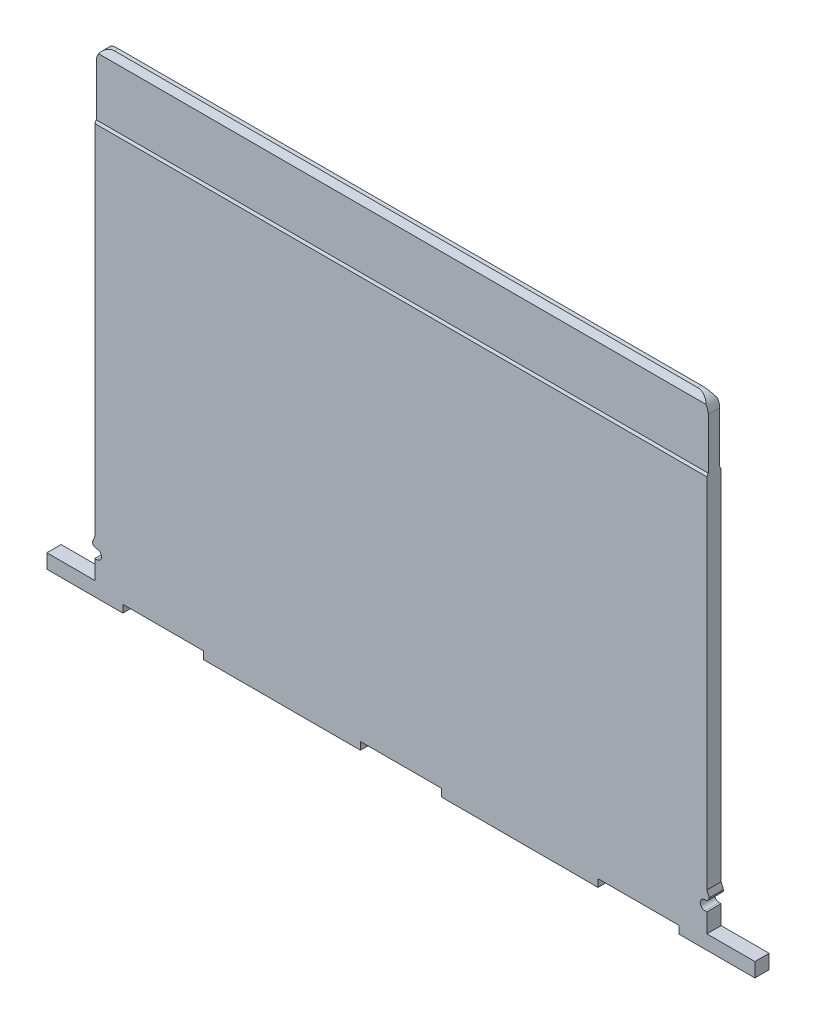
ISO-10303-21;
HEADER;
FILE_DESCRIPTION(('STEP AP214'),'2;1');
FILE_NAME('part.step','',(''),(''),'','','');
FILE_SCHEMA(('AUTOMOTIVE_DESIGN { 1 0 10303 214 1 1 1 1 }'));
ENDSEC;
DATA;
#1=APPLICATION_CONTEXT('core data for automotive mechanical design processes');
#2=APPLICATION_PROTOCOL_DEFINITION('international standard','automotive_design',2000,#1);
#3=PRODUCT_CONTEXT('',#1,'mechanical');
#4=PRODUCT('Part','Part','',(#3));
#5=PRODUCT_RELATED_PRODUCT_CATEGORY('part','',(#4));
#6=PRODUCT_DEFINITION_FORMATION('','',#4);
#7=PRODUCT_DEFINITION_CONTEXT('part definition',#1,'design');
#8=PRODUCT_DEFINITION('design','',#6,#7);
#9=PRODUCT_DEFINITION_SHAPE('','',#8);
#10=(LENGTH_UNIT() NAMED_UNIT(*) SI_UNIT(.MILLI.,.METRE.));
#11=(NAMED_UNIT(*) PLANE_ANGLE_UNIT() SI_UNIT($,.RADIAN.));
#12=(NAMED_UNIT(*) SI_UNIT($,.STERADIAN.) SOLID_ANGLE_UNIT());
#13=UNCERTAINTY_MEASURE_WITH_UNIT(LENGTH_MEASURE(1.E-05),#10,'distance_accuracy_value','');
#14=(GEOMETRIC_REPRESENTATION_CONTEXT(3) GLOBAL_UNCERTAINTY_ASSIGNED_CONTEXT((#13)) GLOBAL_UNIT_ASSIGNED_CONTEXT((#10,
#11,#12)) REPRESENTATION_CONTEXT('',''));
#15=CARTESIAN_POINT('',(0.,0.,0.));
#16=DIRECTION('',(0.,0.,1.));
#17=DIRECTION('',(1.,0.,0.));
#18=AXIS2_PLACEMENT_3D('',#15,#16,#17);
#19=CARTESIAN_POINT('',(10.00000032,12.55776,0.0508));
#20=DIRECTION('',(0.,-0.50000000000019,-0.866025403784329));
#21=DIRECTION('',(0.,0.866025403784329,-0.50000000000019));
#22=AXIS2_PLACEMENT_3D('',#19,#20,#21);
#23=PLANE('',#22);
#24=CARTESIAN_POINT('',(-7.7978,12.17676,0.270770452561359));
#25=DIRECTION('',(0.,-0.50000000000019,-0.866025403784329));
#26=DIRECTION('',(0.,-0.866025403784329,0.50000000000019));
#27=AXIS2_PLACEMENT_3D('',#24,#25,#26);
#28=ELLIPSE('',#27,0.439940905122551,0.381);
#29=CARTESIAN_POINT('',(-8.11893285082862,12.381783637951,0.1524));
#30=VERTEX_POINT('',#29);
#31=CARTESIAN_POINT('',(-7.7978,12.55776,0.0508000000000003));
#32=VERTEX_POINT('',#31);
#33=EDGE_CURVE('E266',#30,#32,#28,.T.);
#34=ORIENTED_EDGE('',*,*,#33,.F.);
#35=DIRECTION('',(-1.,0.,0.));
#36=VECTOR('',#35,1.);
#37=CARTESIAN_POINT('',(10.00000032,12.381783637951,0.1524));
#38=LINE('',#37,#36);
#39=CARTESIAN_POINT('',(8.11893285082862,12.381783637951,0.1524));
#40=VERTEX_POINT('',#39);
#41=EDGE_CURVE('E261',#30,#40,#38,.F.);
#42=ORIENTED_EDGE('',*,*,#41,.T.);
#43=CARTESIAN_POINT('',(7.7978,12.17676,0.270770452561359));
#44=DIRECTION('',(0.,-0.50000000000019,-0.866025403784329));
#45=DIRECTION('',(0.,-0.866025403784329,0.50000000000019));
#46=AXIS2_PLACEMENT_3D('',#43,#44,#45);
#47=ELLIPSE('',#46,0.439940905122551,0.381);
#48=CARTESIAN_POINT('',(7.7978,12.55776,0.0508000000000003));
#49=VERTEX_POINT('',#48);
#50=EDGE_CURVE('E19',#49,#40,#47,.T.);
#51=ORIENTED_EDGE('',*,*,#50,.F.);
#52=DIRECTION('',(1.,0.,0.));
#53=VECTOR('',#52,1.);
#54=CARTESIAN_POINT('',(7.7978,12.55776,0.0508));
#55=LINE('',#54,#53);
#56=EDGE_CURVE('E259',#49,#32,#55,.F.);
#57=ORIENTED_EDGE('',*,*,#56,.T.);
#58=EDGE_LOOP('',(#34,#42,#51,#57));
#59=FACE_BOUND('',#58,.T.);
#60=ADVANCED_FACE('F16',(#59),#23,.F.);
#61=CARTESIAN_POINT('',(7.7978,12.55776,0.399999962));
#62=DIRECTION('',(0.,-1.,0.));
#63=DIRECTION('',(0.,0.,-1.));
#64=AXIS2_PLACEMENT_3D('',#61,#62,#63);
#65=PLANE('',#64);
#66=ORIENTED_EDGE('',*,*,#56,.F.);
#67=DIRECTION('',(0.,0.,-1.));
#68=VECTOR('',#67,1.);
#69=CARTESIAN_POINT('',(7.7978,12.55776,0.399999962));
#70=LINE('',#69,#68);
#71=CARTESIAN_POINT('',(7.7978,12.55776,-0.0507999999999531));
#72=VERTEX_POINT('',#71);
#73=EDGE_CURVE('E271',#72,#49,#70,.F.);
#74=ORIENTED_EDGE('',*,*,#73,.F.);
#75=DIRECTION('',(1.,0.,0.));
#76=VECTOR('',#75,1.);
#77=CARTESIAN_POINT('',(10.00000032,12.55776,-0.0507999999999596));
#78=LINE('',#77,#76);
#79=CARTESIAN_POINT('',(-7.7978,12.55776,-0.0507999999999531));
#80=VERTEX_POINT('',#79);
#81=EDGE_CURVE('E332',#72,#80,#78,.F.);
#82=ORIENTED_EDGE('',*,*,#81,.T.);
#83=DIRECTION('',(0.,0.,-1.));
#84=VECTOR('',#83,1.);
#85=CARTESIAN_POINT('',(-7.7978,12.55776,0.399999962));
#86=LINE('',#85,#84);
#87=EDGE_CURVE('E273',#32,#80,#86,.T.);
#88=ORIENTED_EDGE('',*,*,#87,.F.);
#89=EDGE_LOOP('',(#66,#74,#82,#88));
#90=FACE_BOUND('',#89,.T.);
#91=ADVANCED_FACE('F269',(#90),#65,.F.);
#92=CARTESIAN_POINT('',(10.00000032,12.381783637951,0.1524));
#93=DIRECTION('',(0.,0.,-1.));
#94=DIRECTION('',(-1.,0.,0.));
#95=AXIS2_PLACEMENT_3D('',#92,#93,#94);
#96=PLANE('',#95);
#97=ORIENTED_EDGE('',*,*,#41,.F.);
#98=CARTESIAN_POINT('',(-7.7978,12.17676,0.1524));
#99=DIRECTION('',(0.,0.,1.));
#100=DIRECTION('',(1.,0.,0.));
#101=AXIS2_PLACEMENT_3D('',#98,#99,#100);
#102=CIRCLE('',#101,0.381);
#103=CARTESIAN_POINT('',(-8.1788,12.17676,0.1524));
#104=VERTEX_POINT('',#103);
#105=EDGE_CURVE('E335',#104,#30,#102,.F.);
#106=ORIENTED_EDGE('',*,*,#105,.F.);
#107=DIRECTION('',(0.,1.,0.));
#108=VECTOR('',#107,1.);
#109=CARTESIAN_POINT('',(-8.1788,12.381783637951,0.1524));
#110=LINE('',#109,#108);
#111=CARTESIAN_POINT('',(-8.1788,10.820351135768,0.1524));
#112=VERTEX_POINT('',#111);
#113=EDGE_CURVE('E337',#112,#104,#110,.T.);
#114=ORIENTED_EDGE('',*,*,#113,.F.);
#115=DIRECTION('',(1.,0.,0.));
#116=VECTOR('',#115,1.);
#117=CARTESIAN_POINT('',(10.00000032,10.820351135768,0.1524));
#118=LINE('',#117,#116);
#119=CARTESIAN_POINT('',(8.1788,10.820351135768,0.1524));
#120=VERTEX_POINT('',#119);
#121=EDGE_CURVE('E328',#112,#120,#118,.T.);
#122=ORIENTED_EDGE('',*,*,#121,.T.);
#123=DIRECTION('',(0.,1.,0.));
#124=VECTOR('',#123,1.);
#125=CARTESIAN_POINT('',(8.1788,12.381783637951,0.1524));
#126=LINE('',#125,#124);
#127=CARTESIAN_POINT('',(8.1788,12.17676,0.1524));
#128=VERTEX_POINT('',#127);
#129=EDGE_CURVE('E284',#128,#120,#126,.F.);
#130=ORIENTED_EDGE('',*,*,#129,.F.);
#131=CARTESIAN_POINT('',(7.7978,12.17676,0.1524));
#132=DIRECTION('',(0.,0.,1.));
#133=DIRECTION('',(1.,0.,0.));
#134=AXIS2_PLACEMENT_3D('',#131,#132,#133);
#135=CIRCLE('',#134,0.381);
#136=EDGE_CURVE('E333',#40,#128,#135,.F.);
#137=ORIENTED_EDGE('',*,*,#136,.F.);
#138=EDGE_LOOP('',(#97,#106,#114,#122,#130,#137));
#139=FACE_BOUND('',#138,.T.);
#140=ADVANCED_FACE('F378',(#139),#96,.F.);
#141=CARTESIAN_POINT('',(10.00000032,12.381783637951,-0.1524));
#142=DIRECTION('',(0.,-0.50000000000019,0.866025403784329));
#143=DIRECTION('',(0.,-0.866025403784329,-0.50000000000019));
#144=AXIS2_PLACEMENT_3D('',#141,#142,#143);
#145=PLANE('',#144);
#146=CARTESIAN_POINT('',(-7.7978,12.17676,-0.270770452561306));
#147=DIRECTION('',(0.,-0.50000000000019,0.866025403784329));
#148=DIRECTION('',(0.,0.866025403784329,0.50000000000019));
#149=AXIS2_PLACEMENT_3D('',#146,#147,#148);
#150=ELLIPSE('',#149,0.439940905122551,0.381);
#151=CARTESIAN_POINT('',(-8.11893285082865,12.381783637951,-0.1524));
#152=VERTEX_POINT('',#151);
#153=EDGE_CURVE('E329',#80,#152,#150,.T.);
#154=ORIENTED_EDGE('',*,*,#153,.F.);
#155=ORIENTED_EDGE('',*,*,#81,.F.);
#156=CARTESIAN_POINT('',(7.7978,12.17676,-0.270770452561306));
#157=DIRECTION('',(0.,-0.50000000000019,0.866025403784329));
#158=DIRECTION('',(0.,0.866025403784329,0.50000000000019));
#159=AXIS2_PLACEMENT_3D('',#156,#157,#158);
#160=ELLIPSE('',#159,0.439940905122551,0.381);
#161=CARTESIAN_POINT('',(8.11893285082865,12.381783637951,-0.1524));
#162=VERTEX_POINT('',#161);
#163=EDGE_CURVE('E278',#162,#72,#160,.T.);
#164=ORIENTED_EDGE('',*,*,#163,.F.);
#165=DIRECTION('',(1.,0.,0.));
#166=VECTOR('',#165,1.);
#167=CARTESIAN_POINT('',(10.00000032,12.381783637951,-0.1524));
#168=LINE('',#167,#166);
#169=EDGE_CURVE('E326',#162,#152,#168,.F.);
#170=ORIENTED_EDGE('',*,*,#169,.T.);
#171=EDGE_LOOP('',(#154,#155,#164,#170));
#172=FACE_BOUND('',#171,.T.);
#173=ADVANCED_FACE('F373',(#172),#145,.F.);
#174=CARTESIAN_POINT('',(10.00000032,10.820351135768,0.1524));
#175=DIRECTION('',(0.,-0.50000000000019,-0.866025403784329));
#176=DIRECTION('',(0.,0.866025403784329,-0.50000000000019));
#177=AXIS2_PLACEMENT_3D('',#174,#175,#176);
#178=PLANE('',#177);
#179=DIRECTION('',(0.,0.866025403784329,-0.50000000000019));
#180=VECTOR('',#179,1.);
#181=CARTESIAN_POINT('',(-8.1788,10.820351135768,0.1524));
#182=LINE('',#181,#180);
#183=CARTESIAN_POINT('',(-8.1788,10.75436,0.190499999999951));
#184=VERTEX_POINT('',#183);
#185=EDGE_CURVE('E354',#184,#112,#182,.T.);
#186=ORIENTED_EDGE('',*,*,#185,.F.);
#187=DIRECTION('',(-1.,0.,0.));
#188=VECTOR('',#187,1.);
#189=CARTESIAN_POINT('',(10.00000032,10.75436,0.1905));
#190=LINE('',#189,#188);
#191=CARTESIAN_POINT('',(8.1788,10.75436,0.190499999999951));
#192=VERTEX_POINT('',#191);
#193=EDGE_CURVE('E322',#184,#192,#190,.F.);
#194=ORIENTED_EDGE('',*,*,#193,.T.);
#195=DIRECTION('',(0.,0.866025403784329,-0.50000000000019));
#196=VECTOR('',#195,1.);
#197=CARTESIAN_POINT('',(8.1788,10.820351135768,0.1524));
#198=LINE('',#197,#196);
#199=EDGE_CURVE('E331',#120,#192,#198,.F.);
#200=ORIENTED_EDGE('',*,*,#199,.F.);
#201=ORIENTED_EDGE('',*,*,#121,.F.);
#202=EDGE_LOOP('',(#186,#194,#200,#201));
#203=FACE_BOUND('',#202,.T.);
#204=ADVANCED_FACE('F796',(#203),#178,.F.);
#205=CARTESIAN_POINT('',(7.7978,12.17676,0.399999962));
#206=DIRECTION('',(0.,0.,1.));
#207=DIRECTION('',(1.,0.,0.));
#208=AXIS2_PLACEMENT_3D('',#205,#206,#207);
#209=CYLINDRICAL_SURFACE('',#208,0.381);
#210=ORIENTED_EDGE('',*,*,#163,.T.);
#211=ORIENTED_EDGE('',*,*,#73,.T.);
#212=ORIENTED_EDGE('',*,*,#50,.T.);
#213=ORIENTED_EDGE('',*,*,#136,.T.);
#214=DIRECTION('',(0.,0.,1.));
#215=VECTOR('',#214,1.);
#216=CARTESIAN_POINT('',(8.1788,12.17676,0.399999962));
#217=LINE('',#216,#215);
#218=CARTESIAN_POINT('',(8.1788,12.17676,-0.1524));
#219=VERTEX_POINT('',#218);
#220=EDGE_CURVE('E381',#128,#219,#217,.F.);
#221=ORIENTED_EDGE('',*,*,#220,.T.);
#222=CARTESIAN_POINT('',(7.7978,12.17676,-0.1524));
#223=DIRECTION('',(0.,0.,1.));
#224=DIRECTION('',(1.,0.,0.));
#225=AXIS2_PLACEMENT_3D('',#222,#223,#224);
#226=CIRCLE('',#225,0.381);
#227=EDGE_CURVE('E324',#219,#162,#226,.T.);
#228=ORIENTED_EDGE('',*,*,#227,.T.);
#229=EDGE_LOOP('',(#210,#211,#212,#213,#221,#228));
#230=FACE_BOUND('',#229,.T.);
#231=ADVANCED_FACE('F276',(#230),#209,.T.);
#232=CARTESIAN_POINT('',(10.00000032,10.820351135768,-0.1524));
#233=DIRECTION('',(0.,0.,1.));
#234=DIRECTION('',(1.,0.,0.));
#235=AXIS2_PLACEMENT_3D('',#232,#233,#234);
#236=PLANE('',#235);
#237=DIRECTION('',(0.,1.,0.));
#238=VECTOR('',#237,1.);
#239=CARTESIAN_POINT('',(-8.1788,10.820351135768,-0.1524));
#240=LINE('',#239,#238);
#241=CARTESIAN_POINT('',(-8.1788,12.17676,-0.1524));
#242=VERTEX_POINT('',#241);
#243=CARTESIAN_POINT('',(-8.1788,10.820351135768,-0.152400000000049));
#244=VERTEX_POINT('',#243);
#245=EDGE_CURVE('E323',#242,#244,#240,.F.);
#246=ORIENTED_EDGE('',*,*,#245,.F.);
#247=CARTESIAN_POINT('',(-7.7978,12.17676,-0.1524));
#248=DIRECTION('',(0.,0.,1.));
#249=DIRECTION('',(1.,0.,0.));
#250=AXIS2_PLACEMENT_3D('',#247,#248,#249);
#251=CIRCLE('',#250,0.381);
#252=EDGE_CURVE('E319',#152,#242,#251,.T.);
#253=ORIENTED_EDGE('',*,*,#252,.F.);
#254=ORIENTED_EDGE('',*,*,#169,.F.);
#255=ORIENTED_EDGE('',*,*,#227,.F.);
#256=DIRECTION('',(0.,1.,0.));
#257=VECTOR('',#256,1.);
#258=CARTESIAN_POINT('',(8.1788,1.194000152,-0.1524));
#259=LINE('',#258,#257);
#260=CARTESIAN_POINT('',(8.1788,10.8203511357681,-0.152400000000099));
#261=VERTEX_POINT('',#260);
#262=EDGE_CURVE('E384',#219,#261,#259,.F.);
#263=ORIENTED_EDGE('',*,*,#262,.T.);
#264=DIRECTION('',(1.,0.,0.));
#265=VECTOR('',#264,1.);
#266=CARTESIAN_POINT('',(10.00000032,10.8203511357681,-0.152400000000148));
#267=LINE('',#266,#265);
#268=EDGE_CURVE('E548',#261,#244,#267,.F.);
#269=ORIENTED_EDGE('',*,*,#268,.T.);
#270=EDGE_LOOP('',(#246,#253,#254,#255,#263,#269));
#271=FACE_BOUND('',#270,.T.);
#272=ADVANCED_FACE('F566',(#271),#236,.F.);
#273=CARTESIAN_POINT('',(-7.7978,12.17676,0.399999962));
#274=DIRECTION('',(0.,0.,1.));
#275=DIRECTION('',(1.,0.,0.));
#276=AXIS2_PLACEMENT_3D('',#273,#274,#275);
#277=CYLINDRICAL_SURFACE('',#276,0.381);
#278=ORIENTED_EDGE('',*,*,#153,.T.);
#279=ORIENTED_EDGE('',*,*,#252,.T.);
#280=DIRECTION('',(0.,0.,-1.));
#281=VECTOR('',#280,1.);
#282=CARTESIAN_POINT('',(-8.1788,12.17676,0.399999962));
#283=LINE('',#282,#281);
#284=EDGE_CURVE('E368',#242,#104,#283,.F.);
#285=ORIENTED_EDGE('',*,*,#284,.T.);
#286=ORIENTED_EDGE('',*,*,#105,.T.);
#287=ORIENTED_EDGE('',*,*,#33,.T.);
#288=ORIENTED_EDGE('',*,*,#87,.T.);
#289=EDGE_LOOP('',(#278,#279,#285,#286,#287,#288));
#290=FACE_BOUND('',#289,.T.);
#291=ADVANCED_FACE('F377',(#290),#277,.T.);
#292=CARTESIAN_POINT('',(10.00000032,10.75436,0.1905));
#293=DIRECTION('',(0.,0.,-1.));
#294=DIRECTION('',(-1.,0.,0.));
#295=AXIS2_PLACEMENT_3D('',#292,#293,#294);
#296=PLANE('',#295);
#297=DIRECTION('',(0.,1.,0.));
#298=VECTOR('',#297,1.);
#299=CARTESIAN_POINT('',(-5.271000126,0.,0.1905));
#300=LINE('',#299,#298);
#301=CARTESIAN_POINT('',(-5.271000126,0.,0.1905));
#302=VERTEX_POINT('',#301);
#303=CARTESIAN_POINT('',(-5.271000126,-0.203000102,0.1905));
#304=VERTEX_POINT('',#303);
#305=EDGE_CURVE('E479',#302,#304,#300,.F.);
#306=ORIENTED_EDGE('',*,*,#305,.T.);
#307=DIRECTION('',(1.,0.,0.));
#308=VECTOR('',#307,1.);
#309=CARTESIAN_POINT('',(-5.271000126,-0.203000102,0.1905));
#310=LINE('',#309,#308);
#311=CARTESIAN_POINT('',(-1.080000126,-0.203000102,0.1905));
#312=VERTEX_POINT('',#311);
#313=EDGE_CURVE('E473',#304,#312,#310,.T.);
#314=ORIENTED_EDGE('',*,*,#313,.T.);
#315=DIRECTION('',(0.,1.,0.));
#316=VECTOR('',#315,1.);
#317=CARTESIAN_POINT('',(-1.080000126,-0.203000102,0.1905));
#318=LINE('',#317,#316);
#319=CARTESIAN_POINT('',(-1.080000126,0.,0.1905));
#320=VERTEX_POINT('',#319);
#321=EDGE_CURVE('E467',#312,#320,#318,.T.);
#322=ORIENTED_EDGE('',*,*,#321,.T.);
#323=DIRECTION('',(1.,0.,0.));
#324=VECTOR('',#323,1.);
#325=CARTESIAN_POINT('',(-1.080000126,0.,0.1905));
#326=LINE('',#325,#324);
#327=CARTESIAN_POINT('',(1.080000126,0.,0.1905));
#328=VERTEX_POINT('',#327);
#329=EDGE_CURVE('E461',#320,#328,#326,.T.);
#330=ORIENTED_EDGE('',*,*,#329,.T.);
#331=DIRECTION('',(0.,1.,0.));
#332=VECTOR('',#331,1.);
#333=CARTESIAN_POINT('',(1.080000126,0.,0.1905));
#334=LINE('',#333,#332);
#335=CARTESIAN_POINT('',(1.080000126,-0.2032,0.1905));
#336=VERTEX_POINT('',#335);
#337=EDGE_CURVE('E455',#328,#336,#334,.F.);
#338=ORIENTED_EDGE('',*,*,#337,.T.);
#339=DIRECTION('',(1.,0.,0.));
#340=VECTOR('',#339,1.);
#341=CARTESIAN_POINT('',(1.080000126,-0.2032,0.1905));
#342=LINE('',#341,#340);
#343=CARTESIAN_POINT('',(5.270000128,-0.2032,0.1905));
#344=VERTEX_POINT('',#343);
#345=EDGE_CURVE('E449',#336,#344,#342,.T.);
#346=ORIENTED_EDGE('',*,*,#345,.T.);
#347=DIRECTION('',(0.,1.,0.));
#348=VECTOR('',#347,1.);
#349=CARTESIAN_POINT('',(5.270000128,-0.2032,0.1905));
#350=LINE('',#349,#348);
#351=CARTESIAN_POINT('',(5.270000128,0.,0.1905));
#352=VERTEX_POINT('',#351);
#353=EDGE_CURVE('E443',#344,#352,#350,.T.);
#354=ORIENTED_EDGE('',*,*,#353,.T.);
#355=DIRECTION('',(1.,0.,0.));
#356=VECTOR('',#355,1.);
#357=CARTESIAN_POINT('',(5.270000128,0.,0.1905));
#358=LINE('',#357,#356);
#359=CARTESIAN_POINT('',(7.429000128,0.,0.1905));
#360=VERTEX_POINT('',#359);
#361=EDGE_CURVE('E437',#352,#360,#358,.T.);
#362=ORIENTED_EDGE('',*,*,#361,.T.);
#363=DIRECTION('',(0.,1.,0.));
#364=VECTOR('',#363,1.);
#365=CARTESIAN_POINT('',(7.429000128,0.,0.1905));
#366=LINE('',#365,#364);
#367=CARTESIAN_POINT('',(7.429000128,-0.2032,0.1905));
#368=VERTEX_POINT('',#367);
#369=EDGE_CURVE('E431',#360,#368,#366,.F.);
#370=ORIENTED_EDGE('',*,*,#369,.T.);
#371=DIRECTION('',(1.,0.,0.));
#372=VECTOR('',#371,1.);
#373=CARTESIAN_POINT('',(7.429000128,-0.2032,0.1905));
#374=LINE('',#373,#372);
#375=CARTESIAN_POINT('',(9.46200038,-0.2032,0.1905));
#376=VERTEX_POINT('',#375);
#377=EDGE_CURVE('E425',#368,#376,#374,.T.);
#378=ORIENTED_EDGE('',*,*,#377,.T.);
#379=DIRECTION('',(0.,1.,0.));
#380=VECTOR('',#379,1.);
#381=CARTESIAN_POINT('',(9.46200038,-0.2032,0.1905));
#382=LINE('',#381,#380);
#383=CARTESIAN_POINT('',(9.46200038,0.1778,0.1905));
#384=VERTEX_POINT('',#383);
#385=EDGE_CURVE('E419',#376,#384,#382,.T.);
#386=ORIENTED_EDGE('',*,*,#385,.T.);
#387=DIRECTION('',(1.,0.,0.));
#388=VECTOR('',#387,1.);
#389=CARTESIAN_POINT('',(9.46200038,0.1778,0.1905));
#390=LINE('',#389,#388);
#391=CARTESIAN_POINT('',(8.1788,0.1778,0.1905));
#392=VERTEX_POINT('',#391);
#393=EDGE_CURVE('E413',#384,#392,#390,.F.);
#394=ORIENTED_EDGE('',*,*,#393,.T.);
#395=DIRECTION('',(0.,1.,0.));
#396=VECTOR('',#395,1.);
#397=CARTESIAN_POINT('',(8.1788,0.1778,0.1905));
#398=LINE('',#397,#396);
#399=CARTESIAN_POINT('',(8.1788,0.685999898,0.1905));
#400=VERTEX_POINT('',#399);
#401=EDGE_CURVE('E407',#392,#400,#398,.T.);
#402=ORIENTED_EDGE('',*,*,#401,.T.);
#403=DIRECTION('',(1.,0.,0.));
#404=VECTOR('',#403,1.);
#405=CARTESIAN_POINT('',(8.1788,0.685999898,0.1905));
#406=LINE('',#405,#404);
#407=CARTESIAN_POINT('',(8.128000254,0.685999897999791,0.1905));
#408=VERTEX_POINT('',#407);
#409=EDGE_CURVE('E401',#400,#408,#406,.F.);
#410=ORIENTED_EDGE('',*,*,#409,.T.);
#411=CARTESIAN_POINT('',(8.128067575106,0.813067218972,0.1905));
#412=DIRECTION('',(0.,0.,1.));
#413=DIRECTION('',(1.,0.,0.));
#414=AXIS2_PLACEMENT_3D('',#411,#412,#413);
#415=CIRCLE('',#414,0.127067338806);
#416=CARTESIAN_POINT('',(8.13465617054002,0.939963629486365,0.1905));
#417=VERTEX_POINT('',#416);
#418=EDGE_CURVE('E316',#408,#417,#415,.F.);
#419=ORIENTED_EDGE('',*,*,#418,.T.);
#420=CARTESIAN_POINT('',(8.140003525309,1.041823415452,0.1905));
#421=DIRECTION('',(0.,0.,1.));
#422=DIRECTION('',(1.,0.,0.));
#423=AXIS2_PLACEMENT_3D('',#420,#421,#422);
#424=CIRCLE('',#423,0.10200005);
#425=CARTESIAN_POINT('',(8.24200025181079,1.0410000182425,0.1905));
#426=VERTEX_POINT('',#425);
#427=EDGE_CURVE('E311',#426,#417,#424,.F.);
#428=ORIENTED_EDGE('',*,*,#427,.F.);
#429=DIRECTION('',(0.381783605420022,-0.924251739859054,0.));
#430=VECTOR('',#429,1.);
#431=CARTESIAN_POINT('',(8.242000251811,1.041000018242,0.1905));
#432=LINE('',#431,#430);
#433=CARTESIAN_POINT('',(8.17879999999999,1.19400015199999,0.1905));
#434=VERTEX_POINT('',#433);
#435=EDGE_CURVE('E314',#426,#434,#432,.F.);
#436=ORIENTED_EDGE('',*,*,#435,.T.);
#437=DIRECTION('',(0.,1.,0.));
#438=VECTOR('',#437,1.);
#439=CARTESIAN_POINT('',(8.1788,1.194000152,0.1905));
#440=LINE('',#439,#438);
#441=EDGE_CURVE('E385',#434,#192,#440,.T.);
#442=ORIENTED_EDGE('',*,*,#441,.T.);
#443=ORIENTED_EDGE('',*,*,#193,.F.);
#444=DIRECTION('',(0.,1.,0.));
#445=VECTOR('',#444,1.);
#446=CARTESIAN_POINT('',(-8.1788,12.17676,0.1905));
#447=LINE('',#446,#445);
#448=CARTESIAN_POINT('',(-8.1788,1.194000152,0.1905));
#449=VERTEX_POINT('',#448);
#450=EDGE_CURVE('E545',#184,#449,#447,.F.);
#451=ORIENTED_EDGE('',*,*,#450,.T.);
#452=DIRECTION('',(0.381783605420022,0.924251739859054,0.));
#453=VECTOR('',#452,1.);
#454=CARTESIAN_POINT('',(-8.1788,1.194000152,0.1905));
#455=LINE('',#454,#453);
#456=CARTESIAN_POINT('',(-8.24200025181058,1.04100001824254,0.1905));
#457=VERTEX_POINT('',#456);
#458=EDGE_CURVE('E369',#449,#457,#455,.F.);
#459=ORIENTED_EDGE('',*,*,#458,.T.);
#460=CARTESIAN_POINT('',(-8.140003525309,1.041823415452,0.1905));
#461=DIRECTION('',(0.,0.,1.));
#462=DIRECTION('',(1.,0.,0.));
#463=AXIS2_PLACEMENT_3D('',#460,#461,#462);
#464=CIRCLE('',#463,0.10200005);
#465=CARTESIAN_POINT('',(-8.13465617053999,0.939963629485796,0.1905));
#466=VERTEX_POINT('',#465);
#467=EDGE_CURVE('E307',#466,#457,#464,.F.);
#468=ORIENTED_EDGE('',*,*,#467,.F.);
#469=CARTESIAN_POINT('',(-8.128067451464,0.813067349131,0.1905));
#470=DIRECTION('',(0.,0.,1.));
#471=DIRECTION('',(1.,0.,0.));
#472=AXIS2_PLACEMENT_3D('',#469,#470,#471);
#473=CIRCLE('',#472,0.127067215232);
#474=CARTESIAN_POINT('',(-8.127999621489,0.686000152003,0.1905));
#475=VERTEX_POINT('',#474);
#476=EDGE_CURVE('E302',#466,#475,#473,.F.);
#477=ORIENTED_EDGE('',*,*,#476,.T.);
#478=DIRECTION('',(0.999999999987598,4.98040209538E-06,0.));
#479=VECTOR('',#478,1.);
#480=CARTESIAN_POINT('',(-8.127999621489,0.686000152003,0.1905));
#481=LINE('',#480,#479);
#482=CARTESIAN_POINT('',(-8.179000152,0.68599989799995,0.1905));
#483=VERTEX_POINT('',#482);
#484=EDGE_CURVE('E305',#475,#483,#481,.F.);
#485=ORIENTED_EDGE('',*,*,#484,.T.);
#486=DIRECTION('',(0.,1.,0.));
#487=VECTOR('',#486,1.);
#488=CARTESIAN_POINT('',(-8.179000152,0.685999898,0.1905));
#489=LINE('',#488,#487);
#490=CARTESIAN_POINT('',(-8.179000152,0.1778,0.1905));
#491=VERTEX_POINT('',#490);
#492=EDGE_CURVE('E527',#483,#491,#489,.F.);
#493=ORIENTED_EDGE('',*,*,#492,.T.);
#494=DIRECTION('',(1.,0.,0.));
#495=VECTOR('',#494,1.);
#496=CARTESIAN_POINT('',(-8.179000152,0.1778,0.1905));
#497=LINE('',#496,#495);
#498=CARTESIAN_POINT('',(-9.461000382,0.1778,0.1905));
#499=VERTEX_POINT('',#498);
#500=EDGE_CURVE('E517',#491,#499,#497,.F.);
#501=ORIENTED_EDGE('',*,*,#500,.T.);
#502=DIRECTION('',(0.,1.,0.));
#503=VECTOR('',#502,1.);
#504=CARTESIAN_POINT('',(-9.461000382,0.1778,0.1905));
#505=LINE('',#504,#503);
#506=CARTESIAN_POINT('',(-9.461000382,-0.2032,0.1905));
#507=VERTEX_POINT('',#506);
#508=EDGE_CURVE('E507',#499,#507,#505,.F.);
#509=ORIENTED_EDGE('',*,*,#508,.T.);
#510=DIRECTION('',(1.,0.,0.));
#511=VECTOR('',#510,1.);
#512=CARTESIAN_POINT('',(-9.461000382,-0.2032,0.1905));
#513=LINE('',#512,#511);
#514=CARTESIAN_POINT('',(-7.429000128,-0.2032,0.1905));
#515=VERTEX_POINT('',#514);
#516=EDGE_CURVE('E501',#507,#515,#513,.T.);
#517=ORIENTED_EDGE('',*,*,#516,.T.);
#518=DIRECTION('',(0.,1.,0.));
#519=VECTOR('',#518,1.);
#520=CARTESIAN_POINT('',(-7.429000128,-0.2032,0.1905));
#521=LINE('',#520,#519);
#522=CARTESIAN_POINT('',(-7.429000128,0.,0.1905));
#523=VERTEX_POINT('',#522);
#524=EDGE_CURVE('E486',#515,#523,#521,.T.);
#525=ORIENTED_EDGE('',*,*,#524,.T.);
#526=DIRECTION('',(1.,0.,0.));
#527=VECTOR('',#526,1.);
#528=CARTESIAN_POINT('',(-7.429000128,0.,0.1905));
#529=LINE('',#528,#527);
#530=EDGE_CURVE('E484',#523,#302,#529,.T.);
#531=ORIENTED_EDGE('',*,*,#530,.T.);
#532=EDGE_LOOP('',(#306,#314,#322,#330,#338,#346,#354,#362,#370,#378,#386,#394,#402,#410,#419,
#428,#436,#442,#443,#451,#459,#468,#477,#485,#493,#501,#509,#517,#525,#531));
#533=FACE_BOUND('',#532,.T.);
#534=ADVANCED_FACE('F793',(#533),#296,.F.);
#535=CARTESIAN_POINT('',(-7.429000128,-0.2032,0.399999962));
#536=DIRECTION('',(-1.,0.,0.));
#537=DIRECTION('',(0.,0.,1.));
#538=AXIS2_PLACEMENT_3D('',#535,#536,#537);
#539=PLANE('',#538);
#540=DIRECTION('',(0.,1.,0.));
#541=VECTOR('',#540,1.);
#542=CARTESIAN_POINT('',(-7.429000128,-0.2032,-0.1905));
#543=LINE('',#542,#541);
#544=CARTESIAN_POINT('',(-7.429000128,-0.2032,-0.1905));
#545=VERTEX_POINT('',#544);
#546=CARTESIAN_POINT('',(-7.429000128,0.,-0.1905));
#547=VERTEX_POINT('',#546);
#548=EDGE_CURVE('E514',#545,#547,#543,.T.);
#549=ORIENTED_EDGE('',*,*,#548,.T.);
#550=DIRECTION('',(0.,0.,1.));
#551=VECTOR('',#550,1.);
#552=CARTESIAN_POINT('',(-7.429000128,0.,0.399999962));
#553=LINE('',#552,#551);
#554=EDGE_CURVE('E482',#547,#523,#553,.T.);
#555=ORIENTED_EDGE('',*,*,#554,.T.);
#556=ORIENTED_EDGE('',*,*,#524,.F.);
#557=DIRECTION('',(0.,0.,1.));
#558=VECTOR('',#557,1.);
#559=CARTESIAN_POINT('',(-7.429000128,-0.2032,0.399999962));
#560=LINE('',#559,#558);
#561=EDGE_CURVE('E503',#515,#545,#560,.F.);
#562=ORIENTED_EDGE('',*,*,#561,.T.);
#563=EDGE_LOOP('',(#549,#555,#556,#562));
#564=FACE_BOUND('',#563,.T.);
#565=ADVANCED_FACE('F737',(#564),#539,.F.);
#566=CARTESIAN_POINT('',(-7.429000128,0.,0.399999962));
#567=DIRECTION('',(0.,1.,0.));
#568=DIRECTION('',(0.,0.,1.));
#569=AXIS2_PLACEMENT_3D('',#566,#567,#568);
#570=PLANE('',#569);
#571=DIRECTION('',(1.,0.,0.));
#572=VECTOR('',#571,1.);
#573=CARTESIAN_POINT('',(10.00000032,0.,-0.1905));
#574=LINE('',#573,#572);
#575=CARTESIAN_POINT('',(-5.271000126,0.,-0.1905));
#576=VERTEX_POINT('',#575);
#577=EDGE_CURVE('E716',#547,#576,#574,.T.);
#578=ORIENTED_EDGE('',*,*,#577,.T.);
#579=DIRECTION('',(0.,0.,-1.));
#580=VECTOR('',#579,1.);
#581=CARTESIAN_POINT('',(-5.271000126,0.,0.399999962));
#582=LINE('',#581,#580);
#583=EDGE_CURVE('E476',#576,#302,#582,.F.);
#584=ORIENTED_EDGE('',*,*,#583,.T.);
#585=ORIENTED_EDGE('',*,*,#530,.F.);
#586=ORIENTED_EDGE('',*,*,#554,.F.);
#587=EDGE_LOOP('',(#578,#584,#585,#586));
#588=FACE_BOUND('',#587,.T.);
#589=ADVANCED_FACE('F1063',(#588),#570,.F.);
#590=CARTESIAN_POINT('',(-5.271000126,0.,0.399999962));
#591=DIRECTION('',(1.,0.,0.));
#592=DIRECTION('',(0.,0.,-1.));
#593=AXIS2_PLACEMENT_3D('',#590,#591,#592);
#594=PLANE('',#593);
#595=DIRECTION('',(0.,1.,0.));
#596=VECTOR('',#595,1.);
#597=CARTESIAN_POINT('',(-5.271000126,-0.2032,-0.1905));
#598=LINE('',#597,#596);
#599=CARTESIAN_POINT('',(-5.271000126,-0.203000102,-0.1905));
#600=VERTEX_POINT('',#599);
#601=EDGE_CURVE('E707',#576,#600,#598,.F.);
#602=ORIENTED_EDGE('',*,*,#601,.T.);
#603=DIRECTION('',(0.,0.,1.));
#604=VECTOR('',#603,1.);
#605=CARTESIAN_POINT('',(-5.271000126,-0.203000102,0.399999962));
#606=LINE('',#605,#604);
#607=EDGE_CURVE('E470',#600,#304,#606,.T.);
#608=ORIENTED_EDGE('',*,*,#607,.T.);
#609=ORIENTED_EDGE('',*,*,#305,.F.);
#610=ORIENTED_EDGE('',*,*,#583,.F.);
#611=EDGE_LOOP('',(#602,#608,#609,#610));
#612=FACE_BOUND('',#611,.T.);
#613=ADVANCED_FACE('F1054',(#612),#594,.F.);
#614=CARTESIAN_POINT('',(-5.271000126,-0.203000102,0.399999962));
#615=DIRECTION('',(0.,1.,0.));
#616=DIRECTION('',(0.,0.,1.));
#617=AXIS2_PLACEMENT_3D('',#614,#615,#616);
#618=PLANE('',#617);
#619=DIRECTION('',(1.,0.,0.));
#620=VECTOR('',#619,1.);
#621=CARTESIAN_POINT('',(10.00000032,-0.203000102,-0.1905));
#622=LINE('',#621,#620);
#623=CARTESIAN_POINT('',(-1.080000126,-0.203000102,-0.1905));
#624=VERTEX_POINT('',#623);
#625=EDGE_CURVE('E698',#600,#624,#622,.T.);
#626=ORIENTED_EDGE('',*,*,#625,.T.);
#627=DIRECTION('',(0.,0.,1.));
#628=VECTOR('',#627,1.);
#629=CARTESIAN_POINT('',(-1.080000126,-0.203000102,0.399999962));
#630=LINE('',#629,#628);
#631=EDGE_CURVE('E464',#624,#312,#630,.T.);
#632=ORIENTED_EDGE('',*,*,#631,.T.);
#633=ORIENTED_EDGE('',*,*,#313,.F.);
#634=ORIENTED_EDGE('',*,*,#607,.F.);
#635=EDGE_LOOP('',(#626,#632,#633,#634));
#636=FACE_BOUND('',#635,.T.);
#637=ADVANCED_FACE('F1045',(#636),#618,.F.);
#638=CARTESIAN_POINT('',(-1.080000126,-0.203000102,0.399999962));
#639=DIRECTION('',(-1.,0.,0.));
#640=DIRECTION('',(0.,0.,1.));
#641=AXIS2_PLACEMENT_3D('',#638,#639,#640);
#642=PLANE('',#641);
#643=DIRECTION('',(0.,1.,0.));
#644=VECTOR('',#643,1.);
#645=CARTESIAN_POINT('',(-1.080000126,-0.2032,-0.1905));
#646=LINE('',#645,#644);
#647=CARTESIAN_POINT('',(-1.080000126,0.,-0.1905));
#648=VERTEX_POINT('',#647);
#649=EDGE_CURVE('E689',#624,#648,#646,.T.);
#650=ORIENTED_EDGE('',*,*,#649,.T.);
#651=DIRECTION('',(0.,0.,1.));
#652=VECTOR('',#651,1.);
#653=CARTESIAN_POINT('',(-1.080000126,0.,0.399999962));
#654=LINE('',#653,#652);
#655=EDGE_CURVE('E458',#648,#320,#654,.T.);
#656=ORIENTED_EDGE('',*,*,#655,.T.);
#657=ORIENTED_EDGE('',*,*,#321,.F.);
#658=ORIENTED_EDGE('',*,*,#631,.F.);
#659=EDGE_LOOP('',(#650,#656,#657,#658));
#660=FACE_BOUND('',#659,.T.);
#661=ADVANCED_FACE('F1036',(#660),#642,.F.);
#662=CARTESIAN_POINT('',(-1.080000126,0.,0.399999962));
#663=DIRECTION('',(0.,1.,0.));
#664=DIRECTION('',(0.,0.,1.));
#665=AXIS2_PLACEMENT_3D('',#662,#663,#664);
#666=PLANE('',#665);
#667=DIRECTION('',(1.,0.,0.));
#668=VECTOR('',#667,1.);
#669=CARTESIAN_POINT('',(10.00000032,0.,-0.1905));
#670=LINE('',#669,#668);
#671=CARTESIAN_POINT('',(1.080000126,0.,-0.1905));
#672=VERTEX_POINT('',#671);
#673=EDGE_CURVE('E680',#648,#672,#670,.T.);
#674=ORIENTED_EDGE('',*,*,#673,.T.);
#675=DIRECTION('',(0.,0.,-1.));
#676=VECTOR('',#675,1.);
#677=CARTESIAN_POINT('',(1.080000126,0.,0.399999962));
#678=LINE('',#677,#676);
#679=EDGE_CURVE('E452',#672,#328,#678,.F.);
#680=ORIENTED_EDGE('',*,*,#679,.T.);
#681=ORIENTED_EDGE('',*,*,#329,.F.);
#682=ORIENTED_EDGE('',*,*,#655,.F.);
#683=EDGE_LOOP('',(#674,#680,#681,#682));
#684=FACE_BOUND('',#683,.T.);
#685=ADVANCED_FACE('F1027',(#684),#666,.F.);
#686=CARTESIAN_POINT('',(1.080000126,0.,0.399999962));
#687=DIRECTION('',(1.,0.,0.));
#688=DIRECTION('',(0.,0.,-1.));
#689=AXIS2_PLACEMENT_3D('',#686,#687,#688);
#690=PLANE('',#689);
#691=DIRECTION('',(0.,1.,0.));
#692=VECTOR('',#691,1.);
#693=CARTESIAN_POINT('',(1.080000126,-0.2032,-0.1905));
#694=LINE('',#693,#692);
#695=CARTESIAN_POINT('',(1.080000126,-0.2032,-0.1905));
#696=VERTEX_POINT('',#695);
#697=EDGE_CURVE('E671',#672,#696,#694,.F.);
#698=ORIENTED_EDGE('',*,*,#697,.T.);
#699=DIRECTION('',(0.,0.,1.));
#700=VECTOR('',#699,1.);
#701=CARTESIAN_POINT('',(1.080000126,-0.2032,0.399999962));
#702=LINE('',#701,#700);
#703=EDGE_CURVE('E446',#696,#336,#702,.T.);
#704=ORIENTED_EDGE('',*,*,#703,.T.);
#705=ORIENTED_EDGE('',*,*,#337,.F.);
#706=ORIENTED_EDGE('',*,*,#679,.F.);
#707=EDGE_LOOP('',(#698,#704,#705,#706));
#708=FACE_BOUND('',#707,.T.);
#709=ADVANCED_FACE('F1018',(#708),#690,.F.);
#710=CARTESIAN_POINT('',(1.080000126,-0.2032,0.399999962));
#711=DIRECTION('',(0.,1.,0.));
#712=DIRECTION('',(0.,0.,1.));
#713=AXIS2_PLACEMENT_3D('',#710,#711,#712);
#714=PLANE('',#713);
#715=DIRECTION('',(1.,0.,0.));
#716=VECTOR('',#715,1.);
#717=CARTESIAN_POINT('',(10.00000032,-0.2032,-0.1905));
#718=LINE('',#717,#716);
#719=CARTESIAN_POINT('',(5.270000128,-0.2032,-0.1905));
#720=VERTEX_POINT('',#719);
#721=EDGE_CURVE('E662',#696,#720,#718,.T.);
#722=ORIENTED_EDGE('',*,*,#721,.T.);
#723=DIRECTION('',(0.,0.,1.));
#724=VECTOR('',#723,1.);
#725=CARTESIAN_POINT('',(5.270000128,-0.2032,0.399999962));
#726=LINE('',#725,#724);
#727=EDGE_CURVE('E440',#720,#344,#726,.T.);
#728=ORIENTED_EDGE('',*,*,#727,.T.);
#729=ORIENTED_EDGE('',*,*,#345,.F.);
#730=ORIENTED_EDGE('',*,*,#703,.F.);
#731=EDGE_LOOP('',(#722,#728,#729,#730));
#732=FACE_BOUND('',#731,.T.);
#733=ADVANCED_FACE('F1009',(#732),#714,.F.);
#734=CARTESIAN_POINT('',(5.270000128,-0.2032,0.399999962));
#735=DIRECTION('',(-1.,0.,0.));
#736=DIRECTION('',(0.,0.,1.));
#737=AXIS2_PLACEMENT_3D('',#734,#735,#736);
#738=PLANE('',#737);
#739=DIRECTION('',(0.,1.,0.));
#740=VECTOR('',#739,1.);
#741=CARTESIAN_POINT('',(5.270000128,-0.2032,-0.1905));
#742=LINE('',#741,#740);
#743=CARTESIAN_POINT('',(5.270000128,0.,-0.1905));
#744=VERTEX_POINT('',#743);
#745=EDGE_CURVE('E653',#720,#744,#742,.T.);
#746=ORIENTED_EDGE('',*,*,#745,.T.);
#747=DIRECTION('',(0.,0.,1.));
#748=VECTOR('',#747,1.);
#749=CARTESIAN_POINT('',(5.270000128,0.,0.399999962));
#750=LINE('',#749,#748);
#751=EDGE_CURVE('E434',#744,#352,#750,.T.);
#752=ORIENTED_EDGE('',*,*,#751,.T.);
#753=ORIENTED_EDGE('',*,*,#353,.F.);
#754=ORIENTED_EDGE('',*,*,#727,.F.);
#755=EDGE_LOOP('',(#746,#752,#753,#754));
#756=FACE_BOUND('',#755,.T.);
#757=ADVANCED_FACE('F1000',(#756),#738,.F.);
#758=CARTESIAN_POINT('',(5.270000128,0.,0.399999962));
#759=DIRECTION('',(0.,1.,0.));
#760=DIRECTION('',(0.,0.,1.));
#761=AXIS2_PLACEMENT_3D('',#758,#759,#760);
#762=PLANE('',#761);
#763=DIRECTION('',(1.,0.,0.));
#764=VECTOR('',#763,1.);
#765=CARTESIAN_POINT('',(10.00000032,0.,-0.1905));
#766=LINE('',#765,#764);
#767=CARTESIAN_POINT('',(7.429000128,0.,-0.1905));
#768=VERTEX_POINT('',#767);
#769=EDGE_CURVE('E644',#744,#768,#766,.T.);
#770=ORIENTED_EDGE('',*,*,#769,.T.);
#771=DIRECTION('',(0.,0.,-1.));
#772=VECTOR('',#771,1.);
#773=CARTESIAN_POINT('',(7.429000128,0.,0.399999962));
#774=LINE('',#773,#772);
#775=EDGE_CURVE('E428',#768,#360,#774,.F.);
#776=ORIENTED_EDGE('',*,*,#775,.T.);
#777=ORIENTED_EDGE('',*,*,#361,.F.);
#778=ORIENTED_EDGE('',*,*,#751,.F.);
#779=EDGE_LOOP('',(#770,#776,#777,#778));
#780=FACE_BOUND('',#779,.T.);
#781=ADVANCED_FACE('F991',(#780),#762,.F.);
#782=CARTESIAN_POINT('',(7.429000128,0.,0.399999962));
#783=DIRECTION('',(1.,0.,0.));
#784=DIRECTION('',(0.,0.,-1.));
#785=AXIS2_PLACEMENT_3D('',#782,#783,#784);
#786=PLANE('',#785);
#787=DIRECTION('',(0.,1.,0.));
#788=VECTOR('',#787,1.);
#789=CARTESIAN_POINT('',(7.429000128,-0.2032,-0.1905));
#790=LINE('',#789,#788);
#791=CARTESIAN_POINT('',(7.429000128,-0.2032,-0.1905));
#792=VERTEX_POINT('',#791);
#793=EDGE_CURVE('E635',#768,#792,#790,.F.);
#794=ORIENTED_EDGE('',*,*,#793,.T.);
#795=DIRECTION('',(0.,0.,1.));
#796=VECTOR('',#795,1.);
#797=CARTESIAN_POINT('',(7.429000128,-0.2032,0.399999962));
#798=LINE('',#797,#796);
#799=EDGE_CURVE('E422',#792,#368,#798,.T.);
#800=ORIENTED_EDGE('',*,*,#799,.T.);
#801=ORIENTED_EDGE('',*,*,#369,.F.);
#802=ORIENTED_EDGE('',*,*,#775,.F.);
#803=EDGE_LOOP('',(#794,#800,#801,#802));
#804=FACE_BOUND('',#803,.T.);
#805=ADVANCED_FACE('F982',(#804),#786,.F.);
#806=CARTESIAN_POINT('',(7.429000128,-0.2032,0.399999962));
#807=DIRECTION('',(0.,1.,0.));
#808=DIRECTION('',(0.,0.,1.));
#809=AXIS2_PLACEMENT_3D('',#806,#807,#808);
#810=PLANE('',#809);
#811=DIRECTION('',(1.,0.,0.));
#812=VECTOR('',#811,1.);
#813=CARTESIAN_POINT('',(10.00000032,-0.2032,-0.1905));
#814=LINE('',#813,#812);
#815=CARTESIAN_POINT('',(9.46200038,-0.2032,-0.1905));
#816=VERTEX_POINT('',#815);
#817=EDGE_CURVE('E626',#792,#816,#814,.T.);
#818=ORIENTED_EDGE('',*,*,#817,.T.);
#819=DIRECTION('',(0.,0.,1.));
#820=VECTOR('',#819,1.);
#821=CARTESIAN_POINT('',(9.46200038,-0.2032,0.399999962));
#822=LINE('',#821,#820);
#823=EDGE_CURVE('E416',#816,#376,#822,.T.);
#824=ORIENTED_EDGE('',*,*,#823,.T.);
#825=ORIENTED_EDGE('',*,*,#377,.F.);
#826=ORIENTED_EDGE('',*,*,#799,.F.);
#827=EDGE_LOOP('',(#818,#824,#825,#826));
#828=FACE_BOUND('',#827,.T.);
#829=ADVANCED_FACE('F973',(#828),#810,.F.);
#830=CARTESIAN_POINT('',(9.46200038,-0.2032,0.399999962));
#831=DIRECTION('',(-1.,0.,0.));
#832=DIRECTION('',(0.,0.,1.));
#833=AXIS2_PLACEMENT_3D('',#830,#831,#832);
#834=PLANE('',#833);
#835=DIRECTION('',(0.,1.,0.));
#836=VECTOR('',#835,1.);
#837=CARTESIAN_POINT('',(9.46200038,-0.2032,-0.1905));
#838=LINE('',#837,#836);
#839=CARTESIAN_POINT('',(9.46200038,0.1778,-0.1905));
#840=VERTEX_POINT('',#839);
#841=EDGE_CURVE('E617',#816,#840,#838,.T.);
#842=ORIENTED_EDGE('',*,*,#841,.T.);
#843=DIRECTION('',(0.,0.,-1.));
#844=VECTOR('',#843,1.);
#845=CARTESIAN_POINT('',(9.46200038,0.1778,0.399999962));
#846=LINE('',#845,#844);
#847=EDGE_CURVE('E410',#840,#384,#846,.F.);
#848=ORIENTED_EDGE('',*,*,#847,.T.);
#849=ORIENTED_EDGE('',*,*,#385,.F.);
#850=ORIENTED_EDGE('',*,*,#823,.F.);
#851=EDGE_LOOP('',(#842,#848,#849,#850));
#852=FACE_BOUND('',#851,.T.);
#853=ADVANCED_FACE('F964',(#852),#834,.F.);
#854=CARTESIAN_POINT('',(9.46200038,0.1778,0.399999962));
#855=DIRECTION('',(0.,-1.,0.));
#856=DIRECTION('',(0.,0.,-1.));
#857=AXIS2_PLACEMENT_3D('',#854,#855,#856);
#858=PLANE('',#857);
#859=DIRECTION('',(1.,0.,0.));
#860=VECTOR('',#859,1.);
#861=CARTESIAN_POINT('',(10.00000032,0.1778,-0.1905));
#862=LINE('',#861,#860);
#863=CARTESIAN_POINT('',(8.1788,0.1778,-0.1905));
#864=VERTEX_POINT('',#863);
#865=EDGE_CURVE('E608',#840,#864,#862,.F.);
#866=ORIENTED_EDGE('',*,*,#865,.T.);
#867=DIRECTION('',(0.,0.,1.));
#868=VECTOR('',#867,1.);
#869=CARTESIAN_POINT('',(8.1788,0.1778,0.399999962));
#870=LINE('',#869,#868);
#871=EDGE_CURVE('E404',#864,#392,#870,.T.);
#872=ORIENTED_EDGE('',*,*,#871,.T.);
#873=ORIENTED_EDGE('',*,*,#393,.F.);
#874=ORIENTED_EDGE('',*,*,#847,.F.);
#875=EDGE_LOOP('',(#866,#872,#873,#874));
#876=FACE_BOUND('',#875,.T.);
#877=ADVANCED_FACE('F955',(#876),#858,.F.);
#878=CARTESIAN_POINT('',(8.1788,0.1778,0.399999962));
#879=DIRECTION('',(-1.,0.,0.));
#880=DIRECTION('',(0.,0.,1.));
#881=AXIS2_PLACEMENT_3D('',#878,#879,#880);
#882=PLANE('',#881);
#883=DIRECTION('',(0.,1.,0.));
#884=VECTOR('',#883,1.);
#885=CARTESIAN_POINT('',(8.1788,-0.2032,-0.1905));
#886=LINE('',#885,#884);
#887=CARTESIAN_POINT('',(8.1788,0.685999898,-0.1905));
#888=VERTEX_POINT('',#887);
#889=EDGE_CURVE('E605',#864,#888,#886,.T.);
#890=ORIENTED_EDGE('',*,*,#889,.T.);
#891=DIRECTION('',(0.,0.,-1.));
#892=VECTOR('',#891,1.);
#893=CARTESIAN_POINT('',(8.1788,0.685999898,0.399999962));
#894=LINE('',#893,#892);
#895=EDGE_CURVE('E403',#888,#400,#894,.F.);
#896=ORIENTED_EDGE('',*,*,#895,.T.);
#897=ORIENTED_EDGE('',*,*,#401,.F.);
#898=ORIENTED_EDGE('',*,*,#871,.F.);
#899=EDGE_LOOP('',(#890,#896,#897,#898));
#900=FACE_BOUND('',#899,.T.);
#901=ADVANCED_FACE('F946',(#900),#882,.F.);
#902=CARTESIAN_POINT('',(8.1788,0.685999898,0.399999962));
#903=DIRECTION('',(0.,-1.,0.));
#904=DIRECTION('',(0.,0.,-1.));
#905=AXIS2_PLACEMENT_3D('',#902,#903,#904);
#906=PLANE('',#905);
#907=DIRECTION('',(1.,0.,0.));
#908=VECTOR('',#907,1.);
#909=CARTESIAN_POINT('',(10.00000032,0.685999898,-0.1905));
#910=LINE('',#909,#908);
#911=CARTESIAN_POINT('',(8.128000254,0.685999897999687,-0.1905));
#912=VERTEX_POINT('',#911);
#913=EDGE_CURVE('E301',#888,#912,#910,.F.);
#914=ORIENTED_EDGE('',*,*,#913,.T.);
#915=DIRECTION('',(0.,0.,1.));
#916=VECTOR('',#915,1.);
#917=CARTESIAN_POINT('',(8.128000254,0.685999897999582,0.399999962));
#918=LINE('',#917,#916);
#919=EDGE_CURVE('E318',#912,#408,#918,.T.);
#920=ORIENTED_EDGE('',*,*,#919,.T.);
#921=ORIENTED_EDGE('',*,*,#409,.F.);
#922=ORIENTED_EDGE('',*,*,#895,.F.);
#923=EDGE_LOOP('',(#914,#920,#921,#922));
#924=FACE_BOUND('',#923,.T.);
#925=ADVANCED_FACE('F937',(#924),#906,.F.);
#926=CARTESIAN_POINT('',(8.128067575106,0.813067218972,0.399999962));
#927=DIRECTION('',(0.,0.,1.));
#928=DIRECTION('',(1.,0.,0.));
#929=AXIS2_PLACEMENT_3D('',#926,#927,#928);
#930=CYLINDRICAL_SURFACE('',#929,0.127067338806);
#931=DIRECTION('',(0.,0.,1.));
#932=VECTOR('',#931,1.);
#933=CARTESIAN_POINT('',(8.13465617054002,0.939963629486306,0.399999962));
#934=LINE('',#933,#932);
#935=CARTESIAN_POINT('',(8.13465617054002,0.939963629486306,-0.1905));
#936=VERTEX_POINT('',#935);
#937=EDGE_CURVE('E315',#417,#936,#934,.F.);
#938=ORIENTED_EDGE('',*,*,#937,.F.);
#939=ORIENTED_EDGE('',*,*,#418,.F.);
#940=ORIENTED_EDGE('',*,*,#919,.F.);
#941=CARTESIAN_POINT('',(8.128067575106,0.813067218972,-0.1905));
#942=DIRECTION('',(0.,0.,1.));
#943=DIRECTION('',(1.,0.,0.));
#944=AXIS2_PLACEMENT_3D('',#941,#942,#943);
#945=CIRCLE('',#944,0.127067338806);
#946=EDGE_CURVE('E298',#912,#936,#945,.F.);
#947=ORIENTED_EDGE('',*,*,#946,.T.);
#948=EDGE_LOOP('',(#938,#939,#940,#947));
#949=FACE_BOUND('',#948,.T.);
#950=ADVANCED_FACE('F928',(#949),#930,.F.);
#951=CARTESIAN_POINT('',(8.140003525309,1.041823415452,0.399999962));
#952=DIRECTION('',(0.,0.,1.));
#953=DIRECTION('',(1.,0.,0.));
#954=AXIS2_PLACEMENT_3D('',#951,#952,#953);
#955=CYLINDRICAL_SURFACE('',#954,0.10200005);
#956=DIRECTION('',(0.,0.,1.));
#957=VECTOR('',#956,1.);
#958=CARTESIAN_POINT('',(8.242000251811,1.041000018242,0.399999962));
#959=LINE('',#958,#957);
#960=CARTESIAN_POINT('',(8.24200025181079,1.0410000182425,-0.1905));
#961=VERTEX_POINT('',#960);
#962=EDGE_CURVE('E396',#961,#426,#959,.T.);
#963=ORIENTED_EDGE('',*,*,#962,.T.);
#964=ORIENTED_EDGE('',*,*,#427,.T.);
#965=ORIENTED_EDGE('',*,*,#937,.T.);
#966=CARTESIAN_POINT('',(8.140003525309,1.041823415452,-0.1905));
#967=DIRECTION('',(0.,0.,1.));
#968=DIRECTION('',(1.,0.,0.));
#969=AXIS2_PLACEMENT_3D('',#966,#967,#968);
#970=CIRCLE('',#969,0.10200005);
#971=EDGE_CURVE('E294',#936,#961,#970,.T.);
#972=ORIENTED_EDGE('',*,*,#971,.T.);
#973=EDGE_LOOP('',(#963,#964,#965,#972));
#974=FACE_BOUND('',#973,.T.);
#975=ADVANCED_FACE('F807',(#974),#955,.T.);
#976=CARTESIAN_POINT('',(8.242000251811,1.041000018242,0.399999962));
#977=DIRECTION('',(-0.924251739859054,-0.381783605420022,0.));
#978=DIRECTION('',(0.381783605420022,-0.924251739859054,0.));
#979=AXIS2_PLACEMENT_3D('',#976,#977,#978);
#980=PLANE('',#979);
#981=DIRECTION('',(-0.38178360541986,0.924251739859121,0.));
#982=VECTOR('',#981,1.);
#983=CARTESIAN_POINT('',(8.242000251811,1.041000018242,-0.1905));
#984=LINE('',#983,#982);
#985=CARTESIAN_POINT('',(8.1788,1.194000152,-0.1905));
#986=VERTEX_POINT('',#985);
#987=EDGE_CURVE('E297',#961,#986,#984,.T.);
#988=ORIENTED_EDGE('',*,*,#987,.T.);
#989=DIRECTION('',(0.,0.,1.));
#990=VECTOR('',#989,1.);
#991=CARTESIAN_POINT('',(8.1788,1.194000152,0.399999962));
#992=LINE('',#991,#990);
#993=EDGE_CURVE('E390',#986,#434,#992,.T.);
#994=ORIENTED_EDGE('',*,*,#993,.T.);
#995=ORIENTED_EDGE('',*,*,#435,.F.);
#996=ORIENTED_EDGE('',*,*,#962,.F.);
#997=EDGE_LOOP('',(#988,#994,#995,#996));
#998=FACE_BOUND('',#997,.T.);
#999=ADVANCED_FACE('F799',(#998),#980,.F.);
#1000=CARTESIAN_POINT('',(8.1788,1.194000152,0.399999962));
#1001=DIRECTION('',(-1.,0.,0.));
#1002=DIRECTION('',(0.,0.,1.));
#1003=AXIS2_PLACEMENT_3D('',#1000,#1001,#1002);
#1004=PLANE('',#1003);
#1005=ORIENTED_EDGE('',*,*,#262,.F.);
#1006=ORIENTED_EDGE('',*,*,#220,.F.);
#1007=ORIENTED_EDGE('',*,*,#129,.T.);
#1008=ORIENTED_EDGE('',*,*,#199,.T.);
#1009=ORIENTED_EDGE('',*,*,#441,.F.);
#1010=ORIENTED_EDGE('',*,*,#993,.F.);
#1011=DIRECTION('',(0.,1.,0.));
#1012=VECTOR('',#1011,1.);
#1013=CARTESIAN_POINT('',(8.1788,-0.2032,-0.1905));
#1014=LINE('',#1013,#1012);
#1015=CARTESIAN_POINT('',(8.1788,10.75436,-0.1905));
#1016=VERTEX_POINT('',#1015);
#1017=EDGE_CURVE('E582',#986,#1016,#1014,.T.);
#1018=ORIENTED_EDGE('',*,*,#1017,.T.);
#1019=DIRECTION('',(0.,-0.866025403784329,-0.50000000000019));
#1020=VECTOR('',#1019,1.);
#1021=CARTESIAN_POINT('',(8.1788,10.75436,-0.1905));
#1022=LINE('',#1021,#1020);
#1023=EDGE_CURVE('E387',#1016,#261,#1022,.F.);
#1024=ORIENTED_EDGE('',*,*,#1023,.T.);
#1025=EDGE_LOOP('',(#1005,#1006,#1007,#1008,#1009,#1010,#1018,#1024));
#1026=FACE_BOUND('',#1025,.T.);
#1027=ADVANCED_FACE('F797',(#1026),#1004,.F.);
#1028=CARTESIAN_POINT('',(10.00000032,10.75436,-0.1905));
#1029=DIRECTION('',(0.,-0.50000000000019,0.866025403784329));
#1030=DIRECTION('',(0.,-0.866025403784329,-0.50000000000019));
#1031=AXIS2_PLACEMENT_3D('',#1028,#1029,#1030);
#1032=PLANE('',#1031);
#1033=DIRECTION('',(0.,0.866025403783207,0.500000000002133));
#1034=VECTOR('',#1033,1.);
#1035=CARTESIAN_POINT('',(-8.1788,10.75436,-0.1905));
#1036=LINE('',#1035,#1034);
#1037=CARTESIAN_POINT('',(-8.1788,10.75436,-0.1905));
#1038=VERTEX_POINT('',#1037);
#1039=EDGE_CURVE('E370',#1038,#244,#1036,.T.);
#1040=ORIENTED_EDGE('',*,*,#1039,.T.);
#1041=ORIENTED_EDGE('',*,*,#268,.F.);
#1042=ORIENTED_EDGE('',*,*,#1023,.F.);
#1043=DIRECTION('',(1.,0.,0.));
#1044=VECTOR('',#1043,1.);
#1045=CARTESIAN_POINT('',(10.00000032,10.75436,-0.1905));
#1046=LINE('',#1045,#1044);
#1047=EDGE_CURVE('E572',#1016,#1038,#1046,.F.);
#1048=ORIENTED_EDGE('',*,*,#1047,.T.);
#1049=EDGE_LOOP('',(#1040,#1041,#1042,#1048));
#1050=FACE_BOUND('',#1049,.T.);
#1051=ADVANCED_FACE('F570',(#1050),#1032,.F.);
#1052=CARTESIAN_POINT('',(-8.1788,12.17676,0.399999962));
#1053=DIRECTION('',(1.,0.,0.));
#1054=DIRECTION('',(0.,0.,-1.));
#1055=AXIS2_PLACEMENT_3D('',#1052,#1053,#1054);
#1056=PLANE('',#1055);
#1057=ORIENTED_EDGE('',*,*,#245,.T.);
#1058=ORIENTED_EDGE('',*,*,#1039,.F.);
#1059=DIRECTION('',(0.,1.,0.));
#1060=VECTOR('',#1059,1.);
#1061=CARTESIAN_POINT('',(-8.1788,-0.2032,-0.1905));
#1062=LINE('',#1061,#1060);
#1063=CARTESIAN_POINT('',(-8.1788,1.194000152,-0.1905));
#1064=VERTEX_POINT('',#1063);
#1065=EDGE_CURVE('E581',#1038,#1064,#1062,.F.);
#1066=ORIENTED_EDGE('',*,*,#1065,.T.);
#1067=DIRECTION('',(0.,0.,1.));
#1068=VECTOR('',#1067,1.);
#1069=CARTESIAN_POINT('',(-8.1788,1.194000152,0.399999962));
#1070=LINE('',#1069,#1068);
#1071=EDGE_CURVE('E542',#1064,#449,#1070,.T.);
#1072=ORIENTED_EDGE('',*,*,#1071,.T.);
#1073=ORIENTED_EDGE('',*,*,#450,.F.);
#1074=ORIENTED_EDGE('',*,*,#185,.T.);
#1075=ORIENTED_EDGE('',*,*,#113,.T.);
#1076=ORIENTED_EDGE('',*,*,#284,.F.);
#1077=EDGE_LOOP('',(#1057,#1058,#1066,#1072,#1073,#1074,#1075,#1076));
#1078=FACE_BOUND('',#1077,.T.);
#1079=ADVANCED_FACE('F560',(#1078),#1056,.F.);
#1080=CARTESIAN_POINT('',(-8.1788,1.194000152,0.399999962));
#1081=DIRECTION('',(0.924251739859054,-0.381783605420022,0.));
#1082=DIRECTION('',(0.381783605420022,0.924251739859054,0.));
#1083=AXIS2_PLACEMENT_3D('',#1080,#1081,#1082);
#1084=PLANE('',#1083);
#1085=DIRECTION('',(-0.381783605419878,-0.924251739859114,0.));
#1086=VECTOR('',#1085,1.);
#1087=CARTESIAN_POINT('',(-8.1788,1.194000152,-0.1905));
#1088=LINE('',#1087,#1086);
#1089=CARTESIAN_POINT('',(-8.24200025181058,1.04100001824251,-0.1905));
#1090=VERTEX_POINT('',#1089);
#1091=EDGE_CURVE('E293',#1064,#1090,#1088,.T.);
#1092=ORIENTED_EDGE('',*,*,#1091,.T.);
#1093=DIRECTION('',(0.,0.,1.));
#1094=VECTOR('',#1093,1.);
#1095=CARTESIAN_POINT('',(-8.24200025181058,1.041000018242,0.399999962));
#1096=LINE('',#1095,#1094);
#1097=EDGE_CURVE('E310',#457,#1090,#1096,.F.);
#1098=ORIENTED_EDGE('',*,*,#1097,.F.);
#1099=ORIENTED_EDGE('',*,*,#458,.F.);
#1100=ORIENTED_EDGE('',*,*,#1071,.F.);
#1101=EDGE_LOOP('',(#1092,#1098,#1099,#1100));
#1102=FACE_BOUND('',#1101,.T.);
#1103=ADVANCED_FACE('F791',(#1102),#1084,.F.);
#1104=CARTESIAN_POINT('',(-8.140003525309,1.041823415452,0.399999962));
#1105=DIRECTION('',(0.,0.,1.));
#1106=DIRECTION('',(1.,0.,0.));
#1107=AXIS2_PLACEMENT_3D('',#1104,#1105,#1106);
#1108=CYLINDRICAL_SURFACE('',#1107,0.10200005);
#1109=DIRECTION('',(0.,0.,1.));
#1110=VECTOR('',#1109,1.);
#1111=CARTESIAN_POINT('',(-8.13465617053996,0.939963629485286,0.399999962));
#1112=LINE('',#1111,#1110);
#1113=CARTESIAN_POINT('',(-8.13465617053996,0.939963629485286,-0.1905));
#1114=VERTEX_POINT('',#1113);
#1115=EDGE_CURVE('E306',#1114,#466,#1112,.T.);
#1116=ORIENTED_EDGE('',*,*,#1115,.T.);
#1117=ORIENTED_EDGE('',*,*,#467,.T.);
#1118=ORIENTED_EDGE('',*,*,#1097,.T.);
#1119=CARTESIAN_POINT('',(-8.140003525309,1.041823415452,-0.1905));
#1120=DIRECTION('',(0.,0.,1.));
#1121=DIRECTION('',(1.,0.,0.));
#1122=AXIS2_PLACEMENT_3D('',#1119,#1120,#1121);
#1123=CIRCLE('',#1122,0.10200005);
#1124=EDGE_CURVE('E290',#1090,#1114,#1123,.T.);
#1125=ORIENTED_EDGE('',*,*,#1124,.T.);
#1126=EDGE_LOOP('',(#1116,#1117,#1118,#1125));
#1127=FACE_BOUND('',#1126,.T.);
#1128=ADVANCED_FACE('F834',(#1127),#1108,.T.);
#1129=CARTESIAN_POINT('',(-8.128067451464,0.813067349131,0.399999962));
#1130=DIRECTION('',(0.,0.,1.));
#1131=DIRECTION('',(1.,0.,0.));
#1132=AXIS2_PLACEMENT_3D('',#1129,#1130,#1131);
#1133=CYLINDRICAL_SURFACE('',#1132,0.127067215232);
#1134=DIRECTION('',(0.,0.,1.));
#1135=VECTOR('',#1134,1.);
#1136=CARTESIAN_POINT('',(-8.127999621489,0.686000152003,0.399999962));
#1137=LINE('',#1136,#1135);
#1138=CARTESIAN_POINT('',(-8.127999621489,0.686000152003,-0.1905));
#1139=VERTEX_POINT('',#1138);
#1140=EDGE_CURVE('E530',#1139,#475,#1137,.T.);
#1141=ORIENTED_EDGE('',*,*,#1140,.T.);
#1142=ORIENTED_EDGE('',*,*,#476,.F.);
#1143=ORIENTED_EDGE('',*,*,#1115,.F.);
#1144=CARTESIAN_POINT('',(-8.128067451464,0.813067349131,-0.1905));
#1145=DIRECTION('',(0.,0.,1.));
#1146=DIRECTION('',(1.,0.,0.));
#1147=AXIS2_PLACEMENT_3D('',#1144,#1145,#1146);
#1148=CIRCLE('',#1147,0.127067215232);
#1149=EDGE_CURVE('E286',#1114,#1139,#1148,.F.);
#1150=ORIENTED_EDGE('',*,*,#1149,.T.);
#1151=EDGE_LOOP('',(#1141,#1142,#1143,#1150));
#1152=FACE_BOUND('',#1151,.T.);
#1153=ADVANCED_FACE('F830',(#1152),#1133,.F.);
#1154=CARTESIAN_POINT('',(-8.127999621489,0.686000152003,0.399999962));
#1155=DIRECTION('',(4.98040209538E-06,-0.999999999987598,0.));
#1156=DIRECTION('',(0.999999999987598,4.98040209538E-06,0.));
#1157=AXIS2_PLACEMENT_3D('',#1154,#1155,#1156);
#1158=PLANE('',#1157);
#1159=DIRECTION('',(1.,0.,0.));
#1160=VECTOR('',#1159,1.);
#1161=CARTESIAN_POINT('',(10.00000032,0.686000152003,-0.1905));
#1162=LINE('',#1161,#1160);
#1163=CARTESIAN_POINT('',(-8.179000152,0.686000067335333,-0.1905));
#1164=VERTEX_POINT('',#1163);
#1165=EDGE_CURVE('E289',#1139,#1164,#1162,.F.);
#1166=ORIENTED_EDGE('',*,*,#1165,.T.);
#1167=DIRECTION('',(0.,0.,-1.));
#1168=VECTOR('',#1167,1.);
#1169=CARTESIAN_POINT('',(-8.179000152,0.685999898,0.399999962));
#1170=LINE('',#1169,#1168);
#1171=EDGE_CURVE('E520',#1164,#483,#1170,.F.);
#1172=ORIENTED_EDGE('',*,*,#1171,.T.);
#1173=ORIENTED_EDGE('',*,*,#484,.F.);
#1174=ORIENTED_EDGE('',*,*,#1140,.F.);
#1175=EDGE_LOOP('',(#1166,#1172,#1173,#1174));
#1176=FACE_BOUND('',#1175,.T.);
#1177=ADVANCED_FACE('F826',(#1176),#1158,.F.);
#1178=CARTESIAN_POINT('',(-8.179000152,0.685999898,0.399999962));
#1179=DIRECTION('',(1.,0.,0.));
#1180=DIRECTION('',(0.,0.,-1.));
#1181=AXIS2_PLACEMENT_3D('',#1178,#1179,#1180);
#1182=PLANE('',#1181);
#1183=DIRECTION('',(0.,1.,0.));
#1184=VECTOR('',#1183,1.);
#1185=CARTESIAN_POINT('',(-8.179000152,-0.2032,-0.1905));
#1186=LINE('',#1185,#1184);
#1187=CARTESIAN_POINT('',(-8.179000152,0.1778,-0.1905));
#1188=VERTEX_POINT('',#1187);
#1189=EDGE_CURVE('E750',#1164,#1188,#1186,.F.);
#1190=ORIENTED_EDGE('',*,*,#1189,.T.);
#1191=DIRECTION('',(0.,0.,-1.));
#1192=VECTOR('',#1191,1.);
#1193=CARTESIAN_POINT('',(-8.179000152,0.1778,0.399999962));
#1194=LINE('',#1193,#1192);
#1195=EDGE_CURVE('E510',#1188,#491,#1194,.F.);
#1196=ORIENTED_EDGE('',*,*,#1195,.T.);
#1197=ORIENTED_EDGE('',*,*,#492,.F.);
#1198=ORIENTED_EDGE('',*,*,#1171,.F.);
#1199=EDGE_LOOP('',(#1190,#1196,#1197,#1198));
#1200=FACE_BOUND('',#1199,.T.);
#1201=ADVANCED_FACE('F822',(#1200),#1182,.F.);
#1202=CARTESIAN_POINT('',(-8.179000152,0.1778,0.399999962));
#1203=DIRECTION('',(0.,-1.,0.));
#1204=DIRECTION('',(0.,0.,-1.));
#1205=AXIS2_PLACEMENT_3D('',#1202,#1203,#1204);
#1206=PLANE('',#1205);
#1207=DIRECTION('',(1.,0.,0.));
#1208=VECTOR('',#1207,1.);
#1209=CARTESIAN_POINT('',(10.00000032,0.1778,-0.1905));
#1210=LINE('',#1209,#1208);
#1211=CARTESIAN_POINT('',(-9.461000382,0.1778,-0.1905));
#1212=VERTEX_POINT('',#1211);
#1213=EDGE_CURVE('E748',#1188,#1212,#1210,.F.);
#1214=ORIENTED_EDGE('',*,*,#1213,.T.);
#1215=DIRECTION('',(0.,0.,-1.));
#1216=VECTOR('',#1215,1.);
#1217=CARTESIAN_POINT('',(-9.461000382,0.1778,0.399999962));
#1218=LINE('',#1217,#1216);
#1219=EDGE_CURVE('E504',#1212,#499,#1218,.F.);
#1220=ORIENTED_EDGE('',*,*,#1219,.T.);
#1221=ORIENTED_EDGE('',*,*,#500,.F.);
#1222=ORIENTED_EDGE('',*,*,#1195,.F.);
#1223=EDGE_LOOP('',(#1214,#1220,#1221,#1222));
#1224=FACE_BOUND('',#1223,.T.);
#1225=ADVANCED_FACE('F819',(#1224),#1206,.F.);
#1226=CARTESIAN_POINT('',(-9.461000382,0.1778,0.399999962));
#1227=DIRECTION('',(1.,0.,0.));
#1228=DIRECTION('',(0.,0.,-1.));
#1229=AXIS2_PLACEMENT_3D('',#1226,#1227,#1228);
#1230=PLANE('',#1229);
#1231=DIRECTION('',(0.,1.,0.));
#1232=VECTOR('',#1231,1.);
#1233=CARTESIAN_POINT('',(-9.461000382,-0.2032,-0.1905));
#1234=LINE('',#1233,#1232);
#1235=CARTESIAN_POINT('',(-9.461000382,-0.2032,-0.1905));
#1236=VERTEX_POINT('',#1235);
#1237=EDGE_CURVE('E25',#1212,#1236,#1234,.F.);
#1238=ORIENTED_EDGE('',*,*,#1237,.T.);
#1239=DIRECTION('',(0.,0.,1.));
#1240=VECTOR('',#1239,1.);
#1241=CARTESIAN_POINT('',(-9.461000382,-0.2032,0.399999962));
#1242=LINE('',#1241,#1240);
#1243=EDGE_CURVE('E33',#1236,#507,#1242,.T.);
#1244=ORIENTED_EDGE('',*,*,#1243,.T.);
#1245=ORIENTED_EDGE('',*,*,#508,.F.);
#1246=ORIENTED_EDGE('',*,*,#1219,.F.);
#1247=EDGE_LOOP('',(#1238,#1244,#1245,#1246));
#1248=FACE_BOUND('',#1247,.T.);
#1249=ADVANCED_FACE('F747',(#1248),#1230,.F.);
#1250=CARTESIAN_POINT('',(-9.461000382,-0.2032,0.399999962));
#1251=DIRECTION('',(0.,1.,0.));
#1252=DIRECTION('',(0.,0.,1.));
#1253=AXIS2_PLACEMENT_3D('',#1250,#1251,#1252);
#1254=PLANE('',#1253);
#1255=DIRECTION('',(1.,0.,0.));
#1256=VECTOR('',#1255,1.);
#1257=CARTESIAN_POINT('',(10.00000032,-0.2032,-0.1905));
#1258=LINE('',#1257,#1256);
#1259=EDGE_CURVE('E11',#1236,#545,#1258,.T.);
#1260=ORIENTED_EDGE('',*,*,#1259,.T.);
#1261=ORIENTED_EDGE('',*,*,#561,.F.);
#1262=ORIENTED_EDGE('',*,*,#516,.F.);
#1263=ORIENTED_EDGE('',*,*,#1243,.F.);
#1264=EDGE_LOOP('',(#1260,#1261,#1262,#1263));
#1265=FACE_BOUND('',#1264,.T.);
#1266=ADVANCED_FACE('F738',(#1265),#1254,.F.);
#1267=CARTESIAN_POINT('',(10.00000032,-0.2032,-0.1905));
#1268=DIRECTION('',(0.,0.,1.));
#1269=DIRECTION('',(1.,0.,0.));
#1270=AXIS2_PLACEMENT_3D('',#1267,#1268,#1269);
#1271=PLANE('',#1270);
#1272=ORIENTED_EDGE('',*,*,#1237,.F.);
#1273=ORIENTED_EDGE('',*,*,#1213,.F.);
#1274=ORIENTED_EDGE('',*,*,#1189,.F.);
#1275=ORIENTED_EDGE('',*,*,#1165,.F.);
#1276=ORIENTED_EDGE('',*,*,#1149,.F.);
#1277=ORIENTED_EDGE('',*,*,#1124,.F.);
#1278=ORIENTED_EDGE('',*,*,#1091,.F.);
#1279=ORIENTED_EDGE('',*,*,#1065,.F.);
#1280=ORIENTED_EDGE('',*,*,#1047,.F.);
#1281=ORIENTED_EDGE('',*,*,#1017,.F.);
#1282=ORIENTED_EDGE('',*,*,#987,.F.);
#1283=ORIENTED_EDGE('',*,*,#971,.F.);
#1284=ORIENTED_EDGE('',*,*,#946,.F.);
#1285=ORIENTED_EDGE('',*,*,#913,.F.);
#1286=ORIENTED_EDGE('',*,*,#889,.F.);
#1287=ORIENTED_EDGE('',*,*,#865,.F.);
#1288=ORIENTED_EDGE('',*,*,#841,.F.);
#1289=ORIENTED_EDGE('',*,*,#817,.F.);
#1290=ORIENTED_EDGE('',*,*,#793,.F.);
#1291=ORIENTED_EDGE('',*,*,#769,.F.);
#1292=ORIENTED_EDGE('',*,*,#745,.F.);
#1293=ORIENTED_EDGE('',*,*,#721,.F.);
#1294=ORIENTED_EDGE('',*,*,#697,.F.);
#1295=ORIENTED_EDGE('',*,*,#673,.F.);
#1296=ORIENTED_EDGE('',*,*,#649,.F.);
#1297=ORIENTED_EDGE('',*,*,#625,.F.);
#1298=ORIENTED_EDGE('',*,*,#601,.F.);
#1299=ORIENTED_EDGE('',*,*,#577,.F.);
#1300=ORIENTED_EDGE('',*,*,#548,.F.);
#1301=ORIENTED_EDGE('',*,*,#1259,.F.);
#1302=EDGE_LOOP('',(#1272,#1273,#1274,#1275,#1276,#1277,#1278,#1279,#1280,#1281,#1282,#1283,
#1284,#1285,#1286,#1287,#1288,#1289,#1290,#1291,#1292,#1293,#1294,#1295,#1296,#1297,#1298,#1299,
#1300,#1301));
#1303=FACE_BOUND('',#1302,.T.);
#1304=ADVANCED_FACE('F742',(#1303),#1271,.F.);
#1305=CLOSED_SHELL('',(#60,#91,#140,#173,#204,#231,#272,#291,#534,#565,#589,#613,#637,#661,#685,
#709,#733,#757,#781,#805,#829,#853,#877,#901,#925,#950,#975,#999,#1027,#1051,#1079,#1103,#1128,
#1153,#1177,#1201,#1225,#1249,#1266,#1304));
#1306=MANIFOLD_SOLID_BREP('B1',#1305);
#1307=ADVANCED_BREP_SHAPE_REPRESENTATION('',(#18,#1306),#14);
#1308=SHAPE_DEFINITION_REPRESENTATION(#9,#1307);
ENDSEC;
END-ISO-10303-21;
